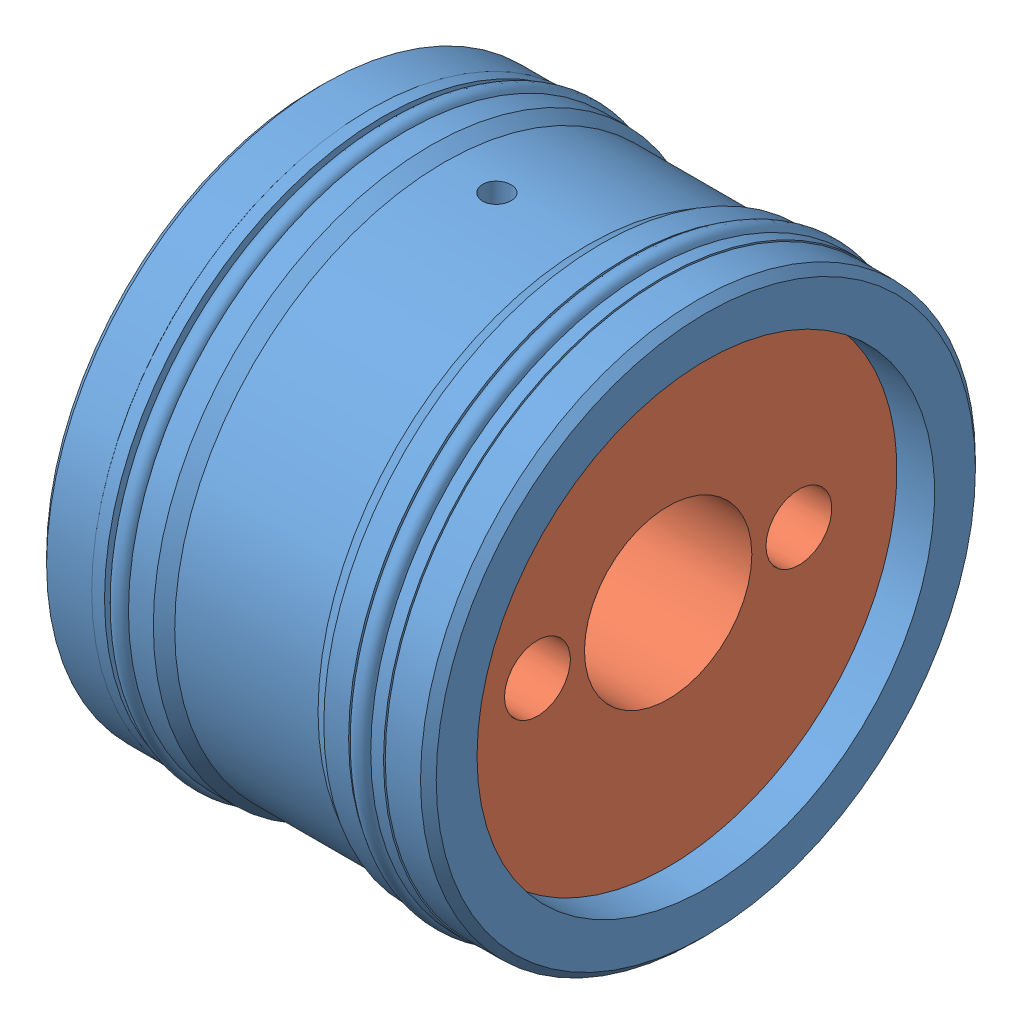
SolidWorks assembly ILC21411601.sldasm, configuration Default (file format 3400). Lengths in mm.
Overall size (46.58 54.79 54.79).
2 component instances, 2 part files, 3 mates.
Components (placement in the parent):
- ILC21411601_BODY-1: ILC21411601_BODY.sldprt [Default] at origin size (37.85 54.79 54.79)
- ILC21411601_PLUNGER-1: ILC21411601_PLUNGER.sldprt [Default] at (15.2654 0 0) x (-1 0 0) z (0 0 1) size (42.93 44.45 44.45)
Mates (geometry in assembly coordinates):
- MID STROKE: distance = 3.6576 mm aligned: plane of ILC21411601_PLUNGER-1 through (15.2654 -8.128 0) normal (1 0 0); plane of ILC21411601_BODY-1 through (18.923 26.9494 0) normal (1 0 0)
- Coincident2: coincident aligned: unknown of ILC21411601_PLUNGER-1
- Concentric2: concentric anti-aligned: cylinder of ILC21411601_BODY-1; cylinder of ILC21411601_PLUNGER-1
